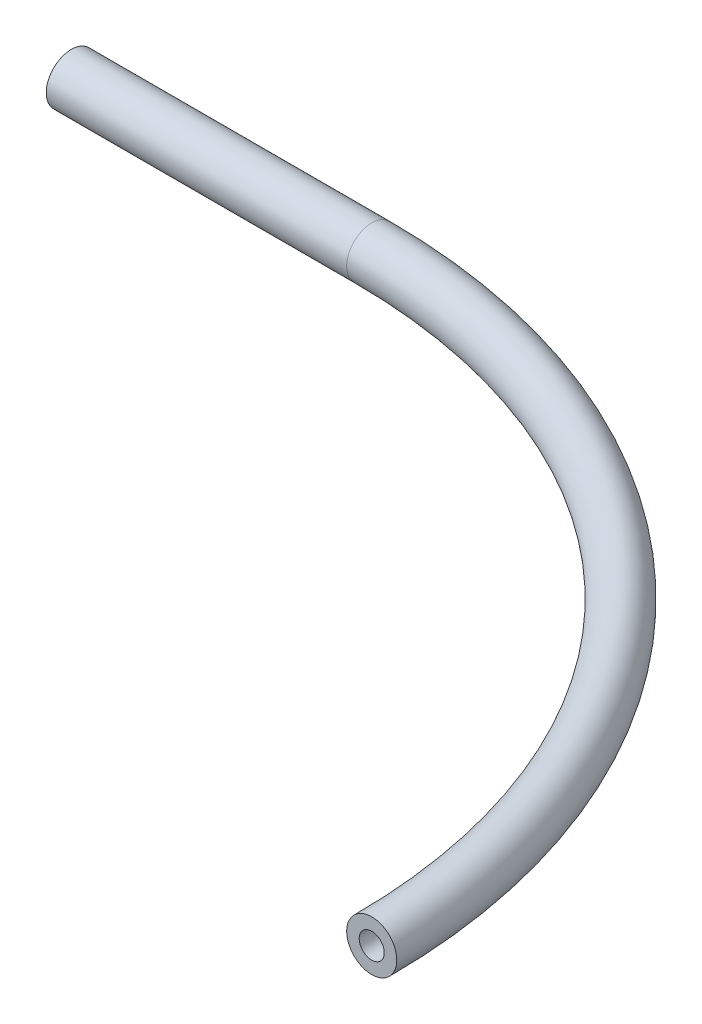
from build123d import *

# Parameters (mm, degrees)
SKETCH2_R   = 1.5875
SKETCH2_R_2 = 0.79375


with BuildPart() as part:
    # Sweep1: sweep along a path in Sketch1
    with BuildLine(Plane(origin=(0, 0, 0), x_dir=(1, 0, 0), z_dir=(0, 1, 0))) as sweep1_path:
        Line((0, 0), (19.05, 0))
        ThreePointArc((19.05, 0), (45.990768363, -11.159231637), (57.15, -38.1))
    # Sketch2 → Sweep1 (sweep)
    with BuildSketch(Plane(origin=(0, 0, 0), x_dir=(0, 0, -1), z_dir=(1, 0, 0))):
        Circle(SKETCH2_R)
        Circle(SKETCH2_R_2, mode=Mode.SUBTRACT)
    sweep(path=sweep1_path.line)


solid = part.part
